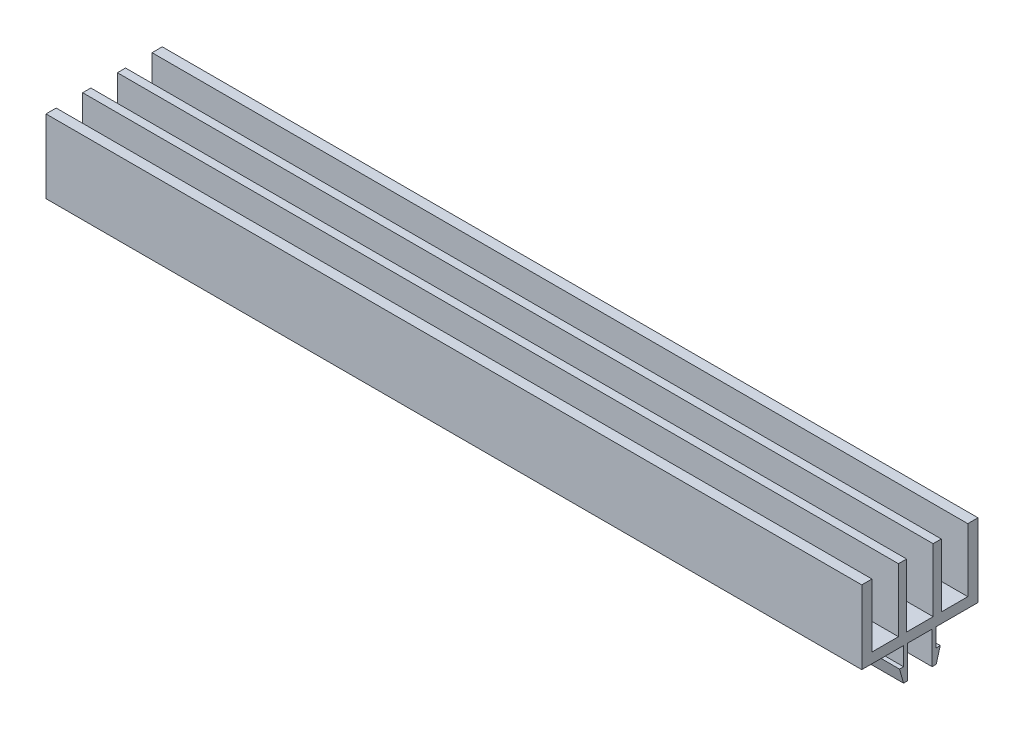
from build123d import *

# Parameters (mm, degrees)
PANEELILIU_UT_1_6025_PANEELILIUKU_3_1_DEPTH = 200


with BuildPart() as part:
    # Sketch1 → Paneeliliu_ut 1.6025 PANEELILIUKU 3_1 (new body)
    with BuildSketch(Plane(origin=(0, 0, 0), x_dir=(0, 0, -1), z_dir=(1, 0, 0))):
        Polygon((4.131105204, -4.934447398), (14.381105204, -4.934447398), (14.381105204, 13.065552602), (11.881105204, 13.065552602), (11.881105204, -2.434447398), (5.381105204, -2.434447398), (5.381105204, 13.065552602), (3.381105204, 13.065552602), (3.381105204, -2.434447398), (-3.118894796, -2.434447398), (-3.118894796, 13.065552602), (-5.118894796, 13.065552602), (-5.118894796, -2.434447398), (-11.618894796, -2.434447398), (-11.618894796, 13.065552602), (-14.118894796, 13.065552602), (-14.118894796, -4.934447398), (-3.868894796, -4.934447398), (-3.868894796, -9.434447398), (-4.868894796, -9.434447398), (-3.868894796, -12.934447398), (-2.868894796, -12.934447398), (-2.868894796, -4.934447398), (3.131105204, -4.934447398), (3.131105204, -12.934447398), (4.131105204, -12.934447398), (5.131105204, -9.434447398), (4.131105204, -9.434447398), align=None)
    extrude(amount=PANEELILIU_UT_1_6025_PANEELILIUKU_3_1_DEPTH)


solid = part.part
